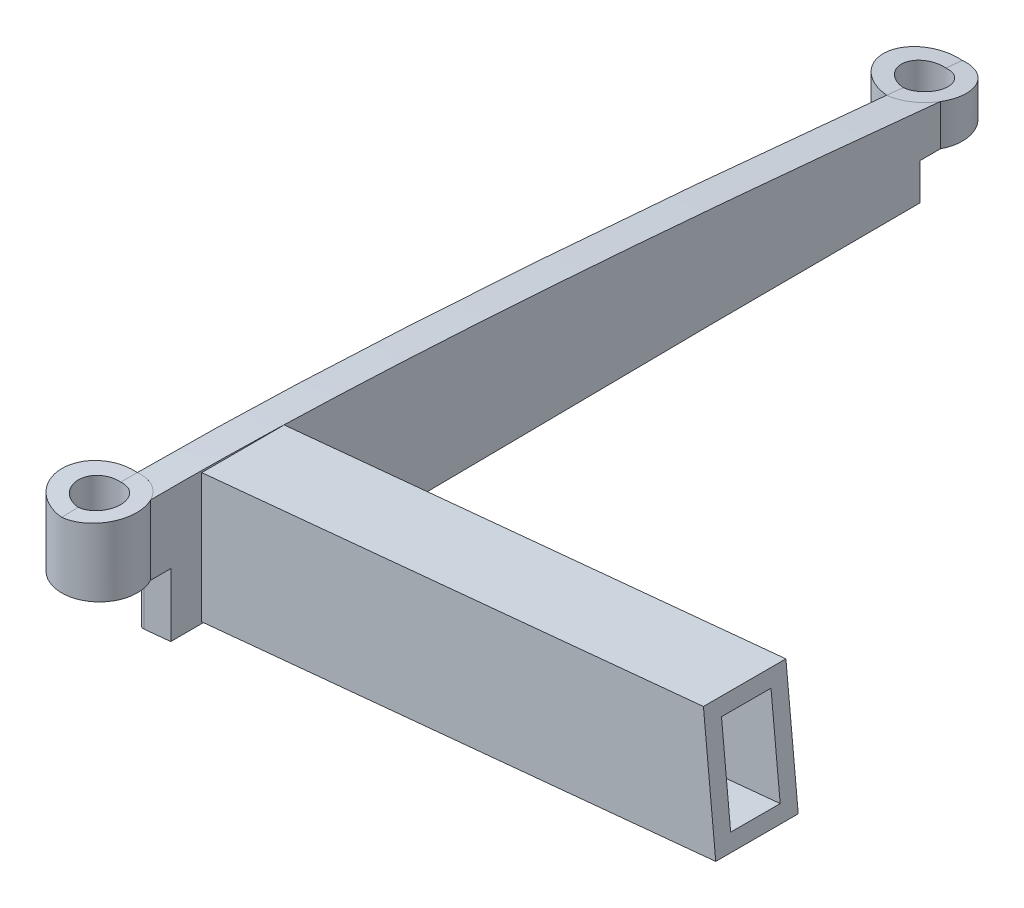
from build123d import *

# Parameters (mm, degrees)
SKETCH16_R              = 2.75
BOSS_EXTRUDE1_DEPTH     = 20
BOSS_EXTRUDE1_2_DEPTH   = 20
SKETCH3_W               = 6
SKETCH3_H               = 9.4
SKETCH22_W              = 3.6
SKETCH22_H              = 7
CUT_EXTRUDE1_DEPTH      = 20
CUT_EXTRUDE1_DEPTH_BACK = 20
SKETCH23_W              = 5.5
SKETCH23_H              = 11.212481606
SKETCH23_H_2            = 9.663247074
SKETCH12_R              = 1.55
CUT_EXTRUDE2_DEPTH      = 20
FILLET1_R               = 0.5
FILLET2_R               = 0.2
CUT_EXTRUDE3_DEPTH      = 60


with BuildPart() as part:
    # Sketch16 → Boss-Extrude1 (new body)
    with BuildSketch(Plane(origin=(0, 0, 0), x_dir=(1, 0, 0), z_dir=(0, 1, 0))):
        with Locations(Location((0, 30, 0), (0, 0, 270))):
            Circle(SKETCH16_R)
    extrude(amount=BOSS_EXTRUDE1_DEPTH)



with BuildPart() as body_2:
    # Sketch16 → Boss-Extrude1 2 (new body)
    with BuildSketch(Plane(origin=(0, 0, 0), x_dir=(1, 0, 0), z_dir=(0, 1, 0))):
        with Locations(Location((0, 90, 0), (0, 0, 270))):
            Circle(SKETCH16_R)
    extrude(amount=BOSS_EXTRUDE1_2_DEPTH)


with BuildPart() as part_1:
    add(part.part)

    add(body_2.part)  # Sweep1 merges body 2
    # Sweep1: sweep along a path in Sketch9
    with BuildLine(Plane.XY) as sweep1_path:
        Line((0, 0), (2.433664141, 0.234335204))
    # Sketch17 → Sweep1 (sweep)
    with BuildSketch(Plane(origin=(0, 0, 0), x_dir=(0, 0, -1), z_dir=(1, 0, 0))):
        with BuildLine():
            Line((90, 6.760356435), (90, 12.280320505))
            add(Edge.make_bspline(
                [(90, 12.280320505), (89.322155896, 12.349650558), (87.930429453, 12.490997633), (85.82475674, 12.70190774), (83.683002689, 12.91244645), (81.541479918, 13.119724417), (79.400072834, 13.322473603), (77.259038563, 13.521546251), (75.118202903, 13.71555231), (72.977789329, 13.905544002), (70.837583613, 14.089585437), (68.697711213, 14.268870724), (66.558295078, 14.442290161), (64.419368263, 14.60935983), (62.281082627, 14.770505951), (60.143287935, 14.924259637), (58.006121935, 15.07152433), (55.86944987, 15.210192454), (53.733713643, 15.341174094), (51.599238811, 15.463789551), (49.466043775, 15.576226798), (47.334215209, 15.678853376), (45.204084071, 15.770993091), (43.075805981, 15.851304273), (40.949672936, 15.919243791), (38.825903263, 15.973616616), (36.704885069, 16.014103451), (34.587026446, 16.03842993), (32.472760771, 16.046747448), (30.944200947, 16.039504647), (30.120453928, 16.030897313), (30, 16.029537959)],
                knots=[0.209093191, 0.209093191, 0.209093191, 0.209093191, 0.215633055, 0.222519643, 0.22940448, 0.236288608, 0.243169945, 0.250049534, 0.256926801, 0.263801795, 0.270673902, 0.277544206, 0.284412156, 0.291275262, 0.298136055, 0.304993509, 0.311846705, 0.318697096, 0.325544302, 0.332383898, 0.339217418, 0.346046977, 0.352868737, 0.359681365, 0.366488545, 0.373285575, 0.380071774, 0.386849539, 0.393613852, 0.400364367, 0.401520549, 0.401520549, 0.401520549, 0.401520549], degree=3))
            Line((30, 16.029537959), (30, 6.399044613))
            add(Edge.make_bspline(
                [(30, 6.399044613), (30.575800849, 6.393929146), (31.864724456, 6.384443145), (33.867803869, 6.376665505), (36.010156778, 6.374597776), (38.154983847, 6.378750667), (40.302161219, 6.387464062), (42.451856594, 6.401180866), (44.603741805, 6.417679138), (46.757271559, 6.436827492), (48.91196073, 6.458343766), (51.067948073, 6.481493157), (53.225220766, 6.505541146), (55.383600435, 6.530691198), (57.543133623, 6.555928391), (59.703437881, 6.581257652), (61.863787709, 6.605877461), (64.023327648, 6.630503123), (66.182020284, 6.653196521), (68.339878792, 6.675582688), (70.496919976, 6.695584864), (72.652851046, 6.714399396), (74.80809057, 6.730438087), (76.962876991, 6.744146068), (79.117261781, 6.754909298), (81.270817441, 6.76319184), (83.423955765, 6.767815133), (85.576718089, 6.76924054), (87.72899575, 6.76746528), (89.203322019, 6.763311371), (89.960203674, 6.760505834), (90, 6.760356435)],
                knots=[0.600232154, 0.600232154, 0.600232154, 0.600232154, 0.605758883, 0.61260351, 0.619457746, 0.626321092, 0.633189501, 0.640066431, 0.646954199, 0.653843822, 0.660736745, 0.667635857, 0.674538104, 0.681443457, 0.688353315, 0.695266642, 0.702179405, 0.709089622, 0.715995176, 0.722899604, 0.729801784, 0.736699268, 0.743592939, 0.750488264, 0.757381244, 0.764270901, 0.77115816, 0.778047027, 0.784933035, 0.79181564, 0.792197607, 0.792197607, 0.792197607, 0.792197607], degree=3))
        make_face()
    sweep(path=sweep1_path.line)

    # Sweep2: sweep along a path in Sketch20
    with BuildLine(Plane.XY) as sweep2_path:
        Line((0, 0), (39.815847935, 3.833830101))
    # Sketch3 → Sweep2 (sweep)
    with BuildSketch(Plane(origin=(0, 0, 0), x_dir=(0, 0, -1), z_dir=(1, 0, 0))):
        with Locations((38, 11.2)):
            Rectangle(SKETCH3_W, SKETCH3_H)
    sweep(path=sweep2_path.line)

    # Cut-Sweep1: sweep along a path in Sketch20_2
    with BuildLine(Plane.XY) as cut_sweep1_path:
        Line((0, 0), (39.815847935, 3.833830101))
    # Sketch22 → Cut-Sweep1 (sweep, cut)
    with BuildSketch(Plane(origin=(0, 0, 0), x_dir=(0, 0, -1), z_dir=(1, 0, 0))):
        with Locations((38, 11.2)):
            Rectangle(SKETCH22_W, SKETCH22_H)
    sweep(path=cut_sweep1_path.line, mode=Mode.SUBTRACT)

    # Cut-Sweep3: sweep along a path in Sketch20_4
    with BuildLine(Plane.XY) as cut_sweep3_path:
        Line((0, 0), (39.815847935, 3.833830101))
    # Sketch7 → Cut-Sweep3 (sweep, cut)
    with BuildSketch(Plane(origin=(0, 0, 0), x_dir=(0, 0, -1), z_dir=(1, 0, 0))):
        with BuildLine():
            Line((7.930309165, 14.033083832), (7.930309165, 39.45066198))
            Line((7.930309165, 39.45066198), (112.626266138, 39.45066198))
            Line((112.626266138, 39.45066198), (112.626266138, 9.816290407))
            add(Edge.make_bspline(
                [(112.626266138, 9.816290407), (112.262385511, 9.857881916), (111.184218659, 9.980906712), (109.391776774, 10.184510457), (107.248816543, 10.425543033), (105.105999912, 10.66457964), (102.96335039, 10.901772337), (100.820740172, 11.13632573), (98.678093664, 11.368388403), (96.535584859, 11.598060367), (94.393219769, 11.824850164), (92.250930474, 12.048950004), (90.10872475, 12.269844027), (87.966660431, 12.487474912), (85.824920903, 12.701997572), (83.683166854, 12.912536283), (81.541644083, 13.11981425), (79.400236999, 13.322563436), (77.259202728, 13.521636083), (75.118367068, 13.715642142), (72.977953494, 13.905633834), (70.837747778, 14.089675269), (68.697875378, 14.268960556), (66.558459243, 14.442379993), (64.419532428, 14.609449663), (62.281246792, 14.770595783), (60.1434521, 14.92434947), (58.0062861, 15.071614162), (55.869614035, 15.210282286), (53.733877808, 15.341263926), (51.599402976, 15.463879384), (49.466207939, 15.57631663), (47.334379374, 15.678943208), (45.204248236, 15.771082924), (43.075970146, 15.851394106), (40.949837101, 15.919333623), (38.826067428, 15.973706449), (36.705049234, 16.014193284), (34.587190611, 16.038519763), (32.472924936, 16.04683728), (30.362747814, 16.036838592), (28.257449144, 16.006351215), (26.157383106, 15.955356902), (24.063985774, 15.879848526), (21.979039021, 15.779671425), (19.904869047, 15.650534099), (17.844809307, 15.489872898), (15.801771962, 15.293760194), (13.78163961, 15.057819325), (11.790906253, 14.776143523), (9.840809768, 14.443096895), (8.560366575, 14.177851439), (7.930309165, 14.033083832)],
                knots=[0.136276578, 0.136276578, 0.136276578, 0.136276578, 0.139791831, 0.146691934, 0.153591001, 0.160489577, 0.167386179, 0.174281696, 0.181177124, 0.188071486, 0.194963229, 0.201854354, 0.208745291, 0.215633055, 0.222519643, 0.22940448, 0.236288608, 0.243169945, 0.250049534, 0.256926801, 0.263801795, 0.270673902, 0.277544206, 0.284412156, 0.291275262, 0.298136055, 0.304993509, 0.311846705, 0.318697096, 0.325544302, 0.332383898, 0.339217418, 0.346046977, 0.352868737, 0.359681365, 0.366488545, 0.373285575, 0.380071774, 0.386849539, 0.393613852, 0.400364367, 0.407102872, 0.413822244, 0.420526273, 0.427207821, 0.433856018, 0.440471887, 0.447039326, 0.453553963, 0.459991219, 0.466334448, 0.472538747, 0.472538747, 0.472538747, 0.472538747], degree=3))
        make_face()
    sweep(path=cut_sweep3_path.line, mode=Mode.SUBTRACT)

    # Cut-Sweep4: sweep along a path in Sketch8
    with BuildLine(Plane.XY) as cut_sweep4_path:
        Line((0, 0), (-39.815847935, 3.833830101))
    # Sketch7_2 → Cut-Sweep4 (sweep, cut)
    with BuildSketch(Plane(origin=(0, 0, 0), x_dir=(0, 0, -1), z_dir=(1, 0, 0))):
        with BuildLine():
            Line((7.930309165, 14.033083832), (7.930309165, 39.45066198))
            Line((7.930309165, 39.45066198), (112.626266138, 39.45066198))
            Line((112.626266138, 39.45066198), (112.626266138, 9.816290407))
            add(Edge.make_bspline(
                [(112.626266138, 9.816290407), (112.262385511, 9.857881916), (111.184218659, 9.980906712), (109.391776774, 10.184510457), (107.248816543, 10.425543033), (105.105999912, 10.66457964), (102.96335039, 10.901772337), (100.820740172, 11.13632573), (98.678093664, 11.368388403), (96.535584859, 11.598060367), (94.393219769, 11.824850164), (92.250930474, 12.048950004), (90.10872475, 12.269844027), (87.966660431, 12.487474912), (85.824920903, 12.701997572), (83.683166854, 12.912536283), (81.541644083, 13.11981425), (79.400236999, 13.322563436), (77.259202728, 13.521636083), (75.118367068, 13.715642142), (72.977953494, 13.905633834), (70.837747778, 14.089675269), (68.697875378, 14.268960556), (66.558459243, 14.442379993), (64.419532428, 14.609449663), (62.281246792, 14.770595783), (60.1434521, 14.92434947), (58.0062861, 15.071614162), (55.869614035, 15.210282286), (53.733877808, 15.341263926), (51.599402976, 15.463879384), (49.466207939, 15.57631663), (47.334379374, 15.678943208), (45.204248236, 15.771082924), (43.075970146, 15.851394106), (40.949837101, 15.919333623), (38.826067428, 15.973706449), (36.705049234, 16.014193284), (34.587190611, 16.038519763), (32.472924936, 16.04683728), (30.362747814, 16.036838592), (28.257449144, 16.006351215), (26.157383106, 15.955356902), (24.063985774, 15.879848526), (21.979039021, 15.779671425), (19.904869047, 15.650534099), (17.844809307, 15.489872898), (15.801771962, 15.293760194), (13.78163961, 15.057819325), (11.790906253, 14.776143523), (9.840809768, 14.443096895), (8.560366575, 14.177851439), (7.930309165, 14.033083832)],
                knots=[0.136276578, 0.136276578, 0.136276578, 0.136276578, 0.139791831, 0.146691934, 0.153591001, 0.160489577, 0.167386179, 0.174281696, 0.181177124, 0.188071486, 0.194963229, 0.201854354, 0.208745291, 0.215633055, 0.222519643, 0.22940448, 0.236288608, 0.243169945, 0.250049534, 0.256926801, 0.263801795, 0.270673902, 0.277544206, 0.284412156, 0.291275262, 0.298136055, 0.304993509, 0.311846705, 0.318697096, 0.325544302, 0.332383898, 0.339217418, 0.346046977, 0.352868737, 0.359681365, 0.366488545, 0.373285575, 0.380071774, 0.386849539, 0.393613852, 0.400364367, 0.407102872, 0.413822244, 0.420526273, 0.427207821, 0.433856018, 0.440471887, 0.447039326, 0.453553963, 0.459991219, 0.466334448, 0.472538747, 0.472538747, 0.472538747, 0.472538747], degree=3))
        make_face()
    sweep(path=cut_sweep4_path.line, mode=Mode.SUBTRACT)

    # Sketch23 → Cut-Extrude1 (cut, two sides: drawn at the far end of the back side and taken through both)
    with BuildSketch(Plane(origin=(0, 0, 0), x_dir=(0, 0, -1), z_dir=(1, 0, 0)).offset(-CUT_EXTRUDE1_DEPTH_BACK)):
        with Locations((30, 5.606240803)):
            Rectangle(SKETCH23_W, SKETCH23_H)
        with Locations((90, 4.831623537)):
            Rectangle(SKETCH23_W, SKETCH23_H_2)
    extrude(amount=CUT_EXTRUDE1_DEPTH + CUT_EXTRUDE1_DEPTH_BACK, mode=Mode.SUBTRACT)

    # Sketch12 → Cut-Extrude2 (cut)
    with BuildSketch(Plane(origin=(0, 0, 0), x_dir=(1, 0, 0), z_dir=(0, 1, 0))):
        with Locations(Location((0, 30, 0), (0, 0, 90))):
            Circle(SKETCH12_R)
        with Locations(Location((0, 90, 0), (0, 0, 90))):
            Circle(SKETCH12_R)
    extrude(amount=CUT_EXTRUDE2_DEPTH, mode=Mode.SUBTRACT)

    # Fillet1
    fillet1_edges = [part_1.edges().sort_by_distance(p)[0] for p in [
        (0, 8.215382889, -87.25),
        (0, 8.796898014, -32.75),
    ]]
    fillet(fillet1_edges, radius=FILLET1_R)

    # Fillet2
    fillet2_edges = [part_1.edges().sort_by_distance(p)[0] for p in [
        (0, 7.7, -38),
        (0, 11.2, -39.8),
        (0, 14.7, -38),
        (0, 11.2, -36.2),
    ]]
    fillet(fillet2_edges, radius=FILLET2_R)

    # Sketch24 → Cut-Extrude3 (cut)
    with BuildSketch(Plane.XY):
        Polygon((39.815847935, 10.333830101), (37.896618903, 30.265785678), (49.2638457, 29.364484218), (47.852822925, 11.568644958), align=None)
    extrude(amount=-CUT_EXTRUDE3_DEPTH, mode=Mode.SUBTRACT)


solid = part_1.part
